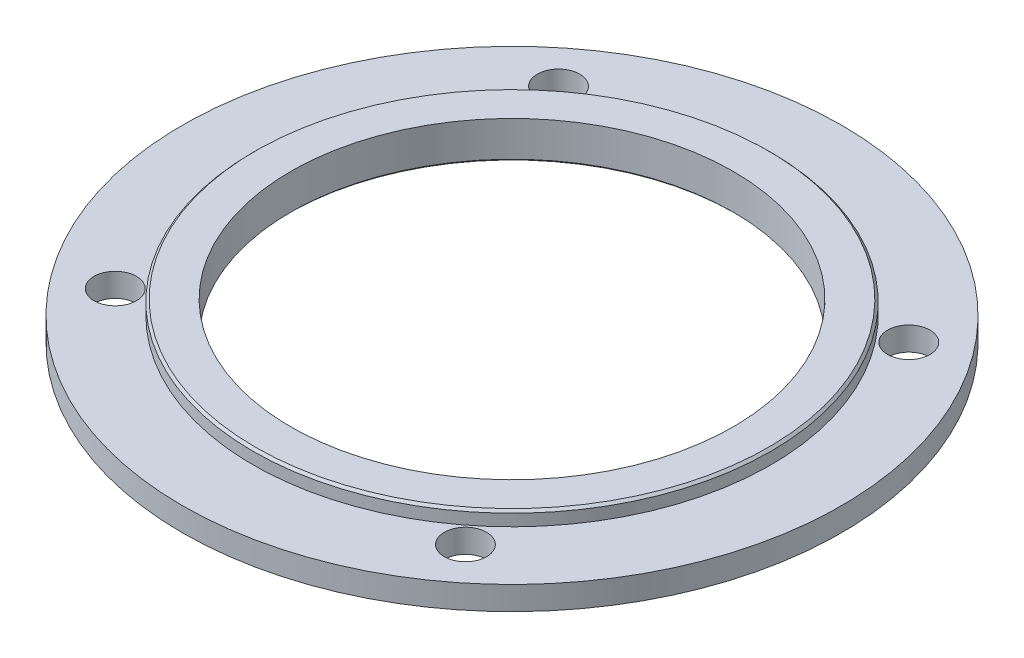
from build123d import *

# Parameters (mm, degrees)
CHANFREIN1_SIZE  = 0.5
D_GAGEMENT_M81_D = 9


with BuildPart() as part:
    # Esquisse1 → R_volution1 (revolve)
    with BuildSketch(Plane.XY, mode=Mode.PRIVATE) as r_volution1_sk:
        Polygon((47, 0), (47, 8), (55, 8), (55, 5), (70, 5), (70, 0), align=None)
    revolve(r_volution1_sk.sketch.rotate(Axis((0, 0, 0), (0, 1, 0)), 90), axis=Axis((0, 0, 0), (0, 1, 0)))

    # Chanfrein1
    chanfrein1_edges = [part.edges().sort_by_distance(p)[0] for p in [
        (0, 0, 47),
        (0, 8, 55),
    ]]
    chamfer(chanfrein1_edges, length=CHANFREIN1_SIZE)

    # D_gagement M81 (through all)
    with Locations(Plane.XZ):
        with Locations((-47.079702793, 37.195451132), (37.195451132, 47.079702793), (47.079702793, -37.195451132), (-37.195451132, -47.079702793)):
            Hole(D_GAGEMENT_M81_D / 2)


solid = part.part
